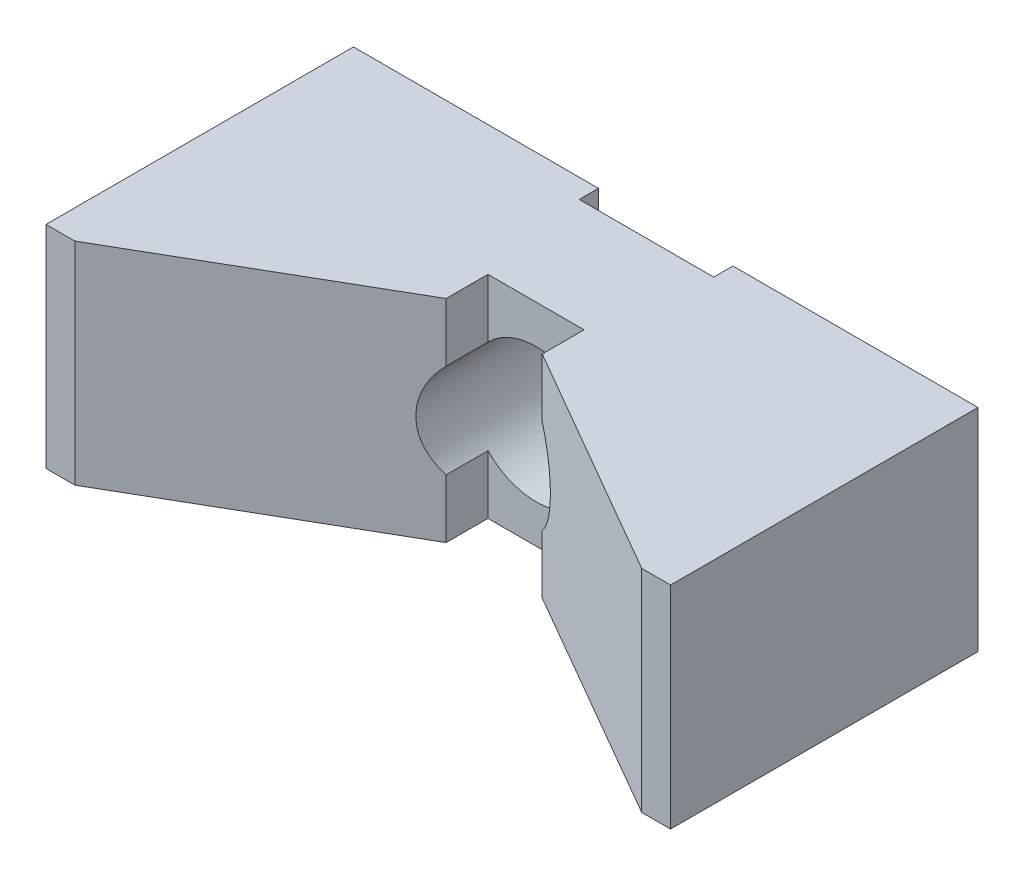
ISO-10303-21;
HEADER;
FILE_DESCRIPTION(('STEP AP214'),'2;1');
FILE_NAME('part.step','',(''),(''),'','','');
FILE_SCHEMA(('AUTOMOTIVE_DESIGN { 1 0 10303 214 1 1 1 1 }'));
ENDSEC;
DATA;
#1=APPLICATION_CONTEXT('core data for automotive mechanical design processes');
#2=APPLICATION_PROTOCOL_DEFINITION('international standard','automotive_design',2000,#1);
#3=PRODUCT_CONTEXT('',#1,'mechanical');
#4=PRODUCT('Part','Part','',(#3));
#5=PRODUCT_RELATED_PRODUCT_CATEGORY('part','',(#4));
#6=PRODUCT_DEFINITION_FORMATION('','',#4);
#7=PRODUCT_DEFINITION_CONTEXT('part definition',#1,'design');
#8=PRODUCT_DEFINITION('design','',#6,#7);
#9=PRODUCT_DEFINITION_SHAPE('','',#8);
#10=(LENGTH_UNIT() NAMED_UNIT(*) SI_UNIT(.MILLI.,.METRE.));
#11=(NAMED_UNIT(*) PLANE_ANGLE_UNIT() SI_UNIT($,.RADIAN.));
#12=(NAMED_UNIT(*) SI_UNIT($,.STERADIAN.) SOLID_ANGLE_UNIT());
#13=UNCERTAINTY_MEASURE_WITH_UNIT(LENGTH_MEASURE(1.E-05),#10,'distance_accuracy_value','');
#14=(GEOMETRIC_REPRESENTATION_CONTEXT(3) GLOBAL_UNCERTAINTY_ASSIGNED_CONTEXT((#13)) GLOBAL_UNIT_ASSIGNED_CONTEXT((#10,
#11,#12)) REPRESENTATION_CONTEXT('',''));
#15=CARTESIAN_POINT('',(0.,0.,0.));
#16=DIRECTION('',(0.,0.,1.));
#17=DIRECTION('',(1.,0.,0.));
#18=AXIS2_PLACEMENT_3D('',#15,#16,#17);
#19=CARTESIAN_POINT('',(-32.5,-11.,0.));
#20=DIRECTION('',(0.,0.,1.));
#21=DIRECTION('',(-1.,0.,0.));
#22=AXIS2_PLACEMENT_3D('',#19,#20,#21);
#23=PLANE('',#22);
#24=DIRECTION('',(1.,0.,0.));
#25=VECTOR('',#24,1.);
#26=CARTESIAN_POINT('',(-32.5,-11.,0.));
#27=LINE('',#26,#25);
#28=CARTESIAN_POINT('',(7.,-11.,0.));
#29=VERTEX_POINT('',#28);
#30=CARTESIAN_POINT('',(32.5,-11.,0.));
#31=VERTEX_POINT('',#30);
#32=EDGE_CURVE('E244',#29,#31,#27,.T.);
#33=ORIENTED_EDGE('',*,*,#32,.F.);
#34=DIRECTION('',(0.,-1.,0.));
#35=VECTOR('',#34,1.);
#36=CARTESIAN_POINT('',(7.,11.,0.));
#37=LINE('',#36,#35);
#38=CARTESIAN_POINT('',(7.,11.,0.));
#39=VERTEX_POINT('',#38);
#40=EDGE_CURVE('E206',#39,#29,#37,.T.);
#41=ORIENTED_EDGE('',*,*,#40,.F.);
#42=DIRECTION('',(1.,0.,0.));
#43=VECTOR('',#42,1.);
#44=CARTESIAN_POINT('',(-32.5,11.,0.));
#45=LINE('',#44,#43);
#46=CARTESIAN_POINT('',(32.5,11.,0.));
#47=VERTEX_POINT('',#46);
#48=EDGE_CURVE('E228',#39,#47,#45,.T.);
#49=ORIENTED_EDGE('',*,*,#48,.T.);
#50=DIRECTION('',(0.,1.,0.));
#51=VECTOR('',#50,1.);
#52=CARTESIAN_POINT('',(32.5,-11.,0.));
#53=LINE('',#52,#51);
#54=EDGE_CURVE('E248',#31,#47,#53,.T.);
#55=ORIENTED_EDGE('',*,*,#54,.F.);
#56=EDGE_LOOP('',(#33,#41,#49,#55));
#57=FACE_BOUND('',#56,.T.);
#58=ADVANCED_FACE('F14',(#57),#23,.F.);
#59=CARTESIAN_POINT('',(32.5,-11.,0.));
#60=DIRECTION('',(-1.,0.,0.));
#61=DIRECTION('',(0.,0.,-1.));
#62=AXIS2_PLACEMENT_3D('',#59,#60,#61);
#63=PLANE('',#62);
#64=DIRECTION('',(0.,0.,1.));
#65=VECTOR('',#64,1.);
#66=CARTESIAN_POINT('',(32.5,11.,0.));
#67=LINE('',#66,#65);
#68=CARTESIAN_POINT('',(32.5,11.,32.));
#69=VERTEX_POINT('',#68);
#70=EDGE_CURVE('E208',#47,#69,#67,.T.);
#71=ORIENTED_EDGE('',*,*,#70,.T.);
#72=DIRECTION('',(0.,1.,0.));
#73=VECTOR('',#72,1.);
#74=CARTESIAN_POINT('',(32.5,-11.,32.));
#75=LINE('',#74,#73);
#76=CARTESIAN_POINT('',(32.5,-11.,32.));
#77=VERTEX_POINT('',#76);
#78=EDGE_CURVE('E263',#77,#69,#75,.T.);
#79=ORIENTED_EDGE('',*,*,#78,.F.);
#80=DIRECTION('',(0.,0.,1.));
#81=VECTOR('',#80,1.);
#82=CARTESIAN_POINT('',(32.5,-11.,0.));
#83=LINE('',#82,#81);
#84=EDGE_CURVE('E232',#31,#77,#83,.T.);
#85=ORIENTED_EDGE('',*,*,#84,.F.);
#86=ORIENTED_EDGE('',*,*,#54,.T.);
#87=EDGE_LOOP('',(#71,#79,#85,#86));
#88=FACE_BOUND('',#87,.T.);
#89=ADVANCED_FACE('F16',(#88),#63,.F.);
#90=CARTESIAN_POINT('',(32.5,-11.,32.));
#91=DIRECTION('',(0.,0.,-1.));
#92=DIRECTION('',(1.,0.,0.));
#93=AXIS2_PLACEMENT_3D('',#90,#91,#92);
#94=PLANE('',#93);
#95=DIRECTION('',(-1.,0.,0.));
#96=VECTOR('',#95,1.);
#97=CARTESIAN_POINT('',(32.5,11.,32.));
#98=LINE('',#97,#96);
#99=CARTESIAN_POINT('',(29.5,11.,32.));
#100=VERTEX_POINT('',#99);
#101=EDGE_CURVE('E217',#69,#100,#98,.T.);
#102=ORIENTED_EDGE('',*,*,#101,.T.);
#103=DIRECTION('',(0.,1.,0.));
#104=VECTOR('',#103,1.);
#105=CARTESIAN_POINT('',(29.5,-11.,32.));
#106=LINE('',#105,#104);
#107=CARTESIAN_POINT('',(29.5,-11.,32.));
#108=VERTEX_POINT('',#107);
#109=EDGE_CURVE('E260',#108,#100,#106,.T.);
#110=ORIENTED_EDGE('',*,*,#109,.F.);
#111=DIRECTION('',(-1.,0.,0.));
#112=VECTOR('',#111,1.);
#113=CARTESIAN_POINT('',(32.5,-11.,32.));
#114=LINE('',#113,#112);
#115=EDGE_CURVE('E235',#77,#108,#114,.T.);
#116=ORIENTED_EDGE('',*,*,#115,.F.);
#117=ORIENTED_EDGE('',*,*,#78,.T.);
#118=EDGE_LOOP('',(#102,#110,#116,#117));
#119=FACE_BOUND('',#118,.T.);
#120=ADVANCED_FACE('F329',(#119),#94,.F.);
#121=CARTESIAN_POINT('',(29.5,-11.,32.));
#122=DIRECTION('',(0.5,0.,-0.86602540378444));
#123=DIRECTION('',(0.86602540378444,0.,0.5));
#124=AXIS2_PLACEMENT_3D('',#121,#122,#123);
#125=PLANE('',#124);
#126=DIRECTION('',(-0.86602540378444,0.,-0.5));
#127=VECTOR('',#126,1.);
#128=CARTESIAN_POINT('',(29.5,11.,32.));
#129=LINE('',#128,#127);
#130=CARTESIAN_POINT('',(5.,11.,17.8549184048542));
#131=VERTEX_POINT('',#130);
#132=EDGE_CURVE('E219',#100,#131,#129,.T.);
#133=ORIENTED_EDGE('',*,*,#132,.T.);
#134=DIRECTION('',(0.,-1.,0.));
#135=VECTOR('',#134,1.);
#136=CARTESIAN_POINT('',(5.,-11.,17.8549184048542));
#137=LINE('',#136,#135);
#138=CARTESIAN_POINT('',(5.,4.89897948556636,17.8549184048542));
#139=VERTEX_POINT('',#138);
#140=EDGE_CURVE('E165',#131,#139,#137,.T.);
#141=ORIENTED_EDGE('',*,*,#140,.T.);
#142=CARTESIAN_POINT('',(0.,0.,14.9681670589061));
#143=DIRECTION('',(0.5,0.,-0.86602540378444));
#144=DIRECTION('',(-0.86602540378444,0.,-0.5));
#145=AXIS2_PLACEMENT_3D('',#142,#143,#144);
#146=ELLIPSE('',#145,8.08290376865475,7.);
#147=CARTESIAN_POINT('',(5.,-4.89897948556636,17.8549184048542));
#148=VERTEX_POINT('',#147);
#149=EDGE_CURVE('E185',#139,#148,#146,.T.);
#150=ORIENTED_EDGE('',*,*,#149,.T.);
#151=CARTESIAN_POINT('',(5.,-11.,17.8549184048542));
#152=VERTEX_POINT('',#151);
#153=EDGE_CURVE('E37',#148,#152,#137,.T.);
#154=ORIENTED_EDGE('',*,*,#153,.T.);
#155=DIRECTION('',(-0.86602540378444,0.,-0.5));
#156=VECTOR('',#155,1.);
#157=CARTESIAN_POINT('',(29.5,-11.,32.));
#158=LINE('',#157,#156);
#159=EDGE_CURVE('E159',#108,#152,#158,.T.);
#160=ORIENTED_EDGE('',*,*,#159,.F.);
#161=ORIENTED_EDGE('',*,*,#109,.T.);
#162=EDGE_LOOP('',(#133,#141,#150,#154,#160,#161));
#163=FACE_BOUND('',#162,.T.);
#164=ADVANCED_FACE('F332',(#163),#125,.F.);
#165=CARTESIAN_POINT('',(-29.5,-11.,32.));
#166=DIRECTION('',(-0.5,0.,-0.86602540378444));
#167=DIRECTION('',(0.86602540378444,0.,-0.5));
#168=AXIS2_PLACEMENT_3D('',#165,#166,#167);
#169=PLANE('',#168);
#170=DIRECTION('',(-0.86602540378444,0.,0.5));
#171=VECTOR('',#170,1.);
#172=CARTESIAN_POINT('',(-29.5,-11.,32.));
#173=LINE('',#172,#171);
#174=CARTESIAN_POINT('',(-5.,-11.,17.8549184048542));
#175=VERTEX_POINT('',#174);
#176=CARTESIAN_POINT('',(-29.5,-11.,32.));
#177=VERTEX_POINT('',#176);
#178=EDGE_CURVE('E238',#175,#177,#173,.T.);
#179=ORIENTED_EDGE('',*,*,#178,.F.);
#180=DIRECTION('',(0.,1.,0.));
#181=VECTOR('',#180,1.);
#182=CARTESIAN_POINT('',(-5.,-11.,17.8549184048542));
#183=LINE('',#182,#181);
#184=CARTESIAN_POINT('',(-5.,-4.89897948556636,17.8549184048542));
#185=VERTEX_POINT('',#184);
#186=EDGE_CURVE('E170',#175,#185,#183,.T.);
#187=ORIENTED_EDGE('',*,*,#186,.T.);
#188=CARTESIAN_POINT('',(0.,0.,14.9681670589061));
#189=DIRECTION('',(-0.5,0.,-0.86602540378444));
#190=DIRECTION('',(0.86602540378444,0.,-0.5));
#191=AXIS2_PLACEMENT_3D('',#188,#189,#190);
#192=ELLIPSE('',#191,8.08290376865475,7.);
#193=CARTESIAN_POINT('',(-5.,4.89897948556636,17.8549184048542));
#194=VERTEX_POINT('',#193);
#195=EDGE_CURVE('E266',#185,#194,#192,.T.);
#196=ORIENTED_EDGE('',*,*,#195,.T.);
#197=CARTESIAN_POINT('',(-5.,11.,17.8549184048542));
#198=VERTEX_POINT('',#197);
#199=EDGE_CURVE('E173',#194,#198,#183,.T.);
#200=ORIENTED_EDGE('',*,*,#199,.T.);
#201=DIRECTION('',(-0.86602540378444,0.,0.5));
#202=VECTOR('',#201,1.);
#203=CARTESIAN_POINT('',(-29.5,11.,32.));
#204=LINE('',#203,#202);
#205=CARTESIAN_POINT('',(-29.5,11.,32.));
#206=VERTEX_POINT('',#205);
#207=EDGE_CURVE('E222',#198,#206,#204,.T.);
#208=ORIENTED_EDGE('',*,*,#207,.T.);
#209=DIRECTION('',(0.,1.,0.));
#210=VECTOR('',#209,1.);
#211=CARTESIAN_POINT('',(-29.5,-11.,32.));
#212=LINE('',#211,#210);
#213=EDGE_CURVE('E257',#177,#206,#212,.T.);
#214=ORIENTED_EDGE('',*,*,#213,.F.);
#215=EDGE_LOOP('',(#179,#187,#196,#200,#208,#214));
#216=FACE_BOUND('',#215,.T.);
#217=ADVANCED_FACE('F288',(#216),#169,.F.);
#218=CARTESIAN_POINT('',(-32.5,-11.,32.));
#219=DIRECTION('',(0.,0.,-1.));
#220=DIRECTION('',(1.,0.,0.));
#221=AXIS2_PLACEMENT_3D('',#218,#219,#220);
#222=PLANE('',#221);
#223=DIRECTION('',(-1.,0.,0.));
#224=VECTOR('',#223,1.);
#225=CARTESIAN_POINT('',(-32.5,11.,32.));
#226=LINE('',#225,#224);
#227=CARTESIAN_POINT('',(-32.5,11.,32.));
#228=VERTEX_POINT('',#227);
#229=EDGE_CURVE('E224',#206,#228,#226,.T.);
#230=ORIENTED_EDGE('',*,*,#229,.T.);
#231=DIRECTION('',(0.,1.,0.));
#232=VECTOR('',#231,1.);
#233=CARTESIAN_POINT('',(-32.5,-11.,32.));
#234=LINE('',#233,#232);
#235=CARTESIAN_POINT('',(-32.5,-11.,32.));
#236=VERTEX_POINT('',#235);
#237=EDGE_CURVE('E254',#236,#228,#234,.T.);
#238=ORIENTED_EDGE('',*,*,#237,.F.);
#239=DIRECTION('',(-1.,0.,0.));
#240=VECTOR('',#239,1.);
#241=CARTESIAN_POINT('',(-32.5,-11.,32.));
#242=LINE('',#241,#240);
#243=EDGE_CURVE('E240',#177,#236,#242,.T.);
#244=ORIENTED_EDGE('',*,*,#243,.F.);
#245=ORIENTED_EDGE('',*,*,#213,.T.);
#246=EDGE_LOOP('',(#230,#238,#244,#245));
#247=FACE_BOUND('',#246,.T.);
#248=ADVANCED_FACE('F295',(#247),#222,.F.);
#249=CARTESIAN_POINT('',(-32.5,-11.,0.));
#250=DIRECTION('',(1.,0.,0.));
#251=DIRECTION('',(0.,0.,1.));
#252=AXIS2_PLACEMENT_3D('',#249,#250,#251);
#253=PLANE('',#252);
#254=DIRECTION('',(0.,0.,-1.));
#255=VECTOR('',#254,1.);
#256=CARTESIAN_POINT('',(-32.5,11.,0.));
#257=LINE('',#256,#255);
#258=CARTESIAN_POINT('',(-32.5,11.,0.));
#259=VERTEX_POINT('',#258);
#260=EDGE_CURVE('E226',#228,#259,#257,.T.);
#261=ORIENTED_EDGE('',*,*,#260,.T.);
#262=DIRECTION('',(0.,1.,0.));
#263=VECTOR('',#262,1.);
#264=CARTESIAN_POINT('',(-32.5,-11.,0.));
#265=LINE('',#264,#263);
#266=CARTESIAN_POINT('',(-32.5,-11.,0.));
#267=VERTEX_POINT('',#266);
#268=EDGE_CURVE('E251',#267,#259,#265,.T.);
#269=ORIENTED_EDGE('',*,*,#268,.F.);
#270=DIRECTION('',(0.,0.,-1.));
#271=VECTOR('',#270,1.);
#272=CARTESIAN_POINT('',(-32.5,-11.,0.));
#273=LINE('',#272,#271);
#274=EDGE_CURVE('E242',#236,#267,#273,.T.);
#275=ORIENTED_EDGE('',*,*,#274,.F.);
#276=ORIENTED_EDGE('',*,*,#237,.T.);
#277=EDGE_LOOP('',(#261,#269,#275,#276));
#278=FACE_BOUND('',#277,.T.);
#279=ADVANCED_FACE('F301',(#278),#253,.F.);
#280=CARTESIAN_POINT('',(-7.,11.,0.));
#281=VERTEX_POINT('',#280);
#282=EDGE_CURVE('E229',#259,#281,#45,.T.);
#283=ORIENTED_EDGE('',*,*,#282,.T.);
#284=DIRECTION('',(0.,-1.,0.));
#285=VECTOR('',#284,1.);
#286=CARTESIAN_POINT('',(-7.,11.,0.));
#287=LINE('',#286,#285);
#288=CARTESIAN_POINT('',(-7.,-11.,0.));
#289=VERTEX_POINT('',#288);
#290=EDGE_CURVE('E209',#281,#289,#287,.T.);
#291=ORIENTED_EDGE('',*,*,#290,.T.);
#292=EDGE_CURVE('E245',#267,#289,#27,.T.);
#293=ORIENTED_EDGE('',*,*,#292,.F.);
#294=ORIENTED_EDGE('',*,*,#268,.T.);
#295=EDGE_LOOP('',(#283,#291,#293,#294));
#296=FACE_BOUND('',#295,.T.);
#297=ADVANCED_FACE('F305',(#296),#23,.F.);
#298=CARTESIAN_POINT('',(32.5,-11.,0.));
#299=DIRECTION('',(0.,1.,0.));
#300=DIRECTION('',(1.,0.,0.));
#301=AXIS2_PLACEMENT_3D('',#298,#299,#300);
#302=PLANE('',#301);
#303=DIRECTION('',(1.,0.,0.));
#304=VECTOR('',#303,1.);
#305=CARTESIAN_POINT('',(5.,-11.,13.5));
#306=LINE('',#305,#304);
#307=CARTESIAN_POINT('',(-5.,-11.,13.5));
#308=VERTEX_POINT('',#307);
#309=CARTESIAN_POINT('',(5.,-11.,13.5));
#310=VERTEX_POINT('',#309);
#311=EDGE_CURVE('E148',#308,#310,#306,.T.);
#312=ORIENTED_EDGE('',*,*,#311,.F.);
#313=DIRECTION('',(0.,0.,-1.));
#314=VECTOR('',#313,1.);
#315=CARTESIAN_POINT('',(-5.,-11.,13.5));
#316=LINE('',#315,#314);
#317=EDGE_CURVE('E145',#175,#308,#316,.T.);
#318=ORIENTED_EDGE('',*,*,#317,.F.);
#319=ORIENTED_EDGE('',*,*,#178,.T.);
#320=ORIENTED_EDGE('',*,*,#243,.T.);
#321=ORIENTED_EDGE('',*,*,#274,.T.);
#322=ORIENTED_EDGE('',*,*,#292,.T.);
#323=DIRECTION('',(0.,0.,-1.));
#324=VECTOR('',#323,1.);
#325=CARTESIAN_POINT('',(-7.,-11.,0.));
#326=LINE('',#325,#324);
#327=CARTESIAN_POINT('',(-7.,-11.,2.));
#328=VERTEX_POINT('',#327);
#329=EDGE_CURVE('E194',#328,#289,#326,.T.);
#330=ORIENTED_EDGE('',*,*,#329,.F.);
#331=DIRECTION('',(-1.,0.,0.));
#332=VECTOR('',#331,1.);
#333=CARTESIAN_POINT('',(7.,-11.,2.));
#334=LINE('',#333,#332);
#335=CARTESIAN_POINT('',(7.,-11.,2.));
#336=VERTEX_POINT('',#335);
#337=EDGE_CURVE('E191',#336,#328,#334,.T.);
#338=ORIENTED_EDGE('',*,*,#337,.F.);
#339=DIRECTION('',(0.,0.,1.));
#340=VECTOR('',#339,1.);
#341=CARTESIAN_POINT('',(7.,-11.,0.));
#342=LINE('',#341,#340);
#343=EDGE_CURVE('E188',#29,#336,#342,.T.);
#344=ORIENTED_EDGE('',*,*,#343,.F.);
#345=ORIENTED_EDGE('',*,*,#32,.T.);
#346=ORIENTED_EDGE('',*,*,#84,.T.);
#347=ORIENTED_EDGE('',*,*,#115,.T.);
#348=ORIENTED_EDGE('',*,*,#159,.T.);
#349=DIRECTION('',(0.,0.,1.));
#350=VECTOR('',#349,1.);
#351=CARTESIAN_POINT('',(5.,-11.,13.5));
#352=LINE('',#351,#350);
#353=EDGE_CURVE('E141',#310,#152,#352,.T.);
#354=ORIENTED_EDGE('',*,*,#353,.F.);
#355=EDGE_LOOP('',(#312,#318,#319,#320,#321,#322,#330,#338,#344,#345,#346,#347,#348,#354));
#356=FACE_BOUND('',#355,.T.);
#357=ADVANCED_FACE('F157',(#356),#302,.F.);
#358=CARTESIAN_POINT('',(32.5,11.,0.));
#359=DIRECTION('',(0.,1.,0.));
#360=DIRECTION('',(1.,0.,0.));
#361=AXIS2_PLACEMENT_3D('',#358,#359,#360);
#362=PLANE('',#361);
#363=DIRECTION('',(0.,0.,1.));
#364=VECTOR('',#363,1.);
#365=CARTESIAN_POINT('',(-5.,11.,0.));
#366=LINE('',#365,#364);
#367=CARTESIAN_POINT('',(-5.,11.,13.5));
#368=VERTEX_POINT('',#367);
#369=EDGE_CURVE('E174',#368,#198,#366,.T.);
#370=ORIENTED_EDGE('',*,*,#369,.F.);
#371=DIRECTION('',(-1.,0.,0.));
#372=VECTOR('',#371,1.);
#373=CARTESIAN_POINT('',(32.5,11.,13.5));
#374=LINE('',#373,#372);
#375=CARTESIAN_POINT('',(5.,11.,13.5));
#376=VERTEX_POINT('',#375);
#377=EDGE_CURVE('E176',#376,#368,#374,.T.);
#378=ORIENTED_EDGE('',*,*,#377,.F.);
#379=DIRECTION('',(0.,0.,-1.));
#380=VECTOR('',#379,1.);
#381=CARTESIAN_POINT('',(5.,11.,0.));
#382=LINE('',#381,#380);
#383=EDGE_CURVE('E168',#131,#376,#382,.T.);
#384=ORIENTED_EDGE('',*,*,#383,.F.);
#385=ORIENTED_EDGE('',*,*,#132,.F.);
#386=ORIENTED_EDGE('',*,*,#101,.F.);
#387=ORIENTED_EDGE('',*,*,#70,.F.);
#388=ORIENTED_EDGE('',*,*,#48,.F.);
#389=DIRECTION('',(0.,0.,1.));
#390=VECTOR('',#389,1.);
#391=CARTESIAN_POINT('',(7.,11.,0.));
#392=LINE('',#391,#390);
#393=CARTESIAN_POINT('',(7.,11.,2.));
#394=VERTEX_POINT('',#393);
#395=EDGE_CURVE('E196',#39,#394,#392,.T.);
#396=ORIENTED_EDGE('',*,*,#395,.T.);
#397=DIRECTION('',(-1.,0.,0.));
#398=VECTOR('',#397,1.);
#399=CARTESIAN_POINT('',(7.,11.,2.));
#400=LINE('',#399,#398);
#401=CARTESIAN_POINT('',(-7.,11.,2.));
#402=VERTEX_POINT('',#401);
#403=EDGE_CURVE('E199',#394,#402,#400,.T.);
#404=ORIENTED_EDGE('',*,*,#403,.T.);
#405=DIRECTION('',(0.,0.,-1.));
#406=VECTOR('',#405,1.);
#407=CARTESIAN_POINT('',(-7.,11.,0.));
#408=LINE('',#407,#406);
#409=EDGE_CURVE('E202',#402,#281,#408,.T.);
#410=ORIENTED_EDGE('',*,*,#409,.T.);
#411=ORIENTED_EDGE('',*,*,#282,.F.);
#412=ORIENTED_EDGE('',*,*,#260,.F.);
#413=ORIENTED_EDGE('',*,*,#229,.F.);
#414=ORIENTED_EDGE('',*,*,#207,.F.);
#415=EDGE_LOOP('',(#370,#378,#384,#385,#386,#387,#388,#396,#404,#410,#411,#412,#413,#414));
#416=FACE_BOUND('',#415,.T.);
#417=ADVANCED_FACE('F311',(#416),#362,.T.);
#418=CARTESIAN_POINT('',(7.,11.,0.));
#419=DIRECTION('',(1.,0.,0.));
#420=DIRECTION('',(0.,0.,1.));
#421=AXIS2_PLACEMENT_3D('',#418,#419,#420);
#422=PLANE('',#421);
#423=DIRECTION('',(0.,-1.,0.));
#424=VECTOR('',#423,1.);
#425=CARTESIAN_POINT('',(7.,11.,2.));
#426=LINE('',#425,#424);
#427=EDGE_CURVE('E205',#394,#336,#426,.T.);
#428=ORIENTED_EDGE('',*,*,#427,.F.);
#429=ORIENTED_EDGE('',*,*,#395,.F.);
#430=ORIENTED_EDGE('',*,*,#40,.T.);
#431=ORIENTED_EDGE('',*,*,#343,.T.);
#432=EDGE_LOOP('',(#428,#429,#430,#431));
#433=FACE_BOUND('',#432,.T.);
#434=ADVANCED_FACE('F485',(#433),#422,.F.);
#435=CARTESIAN_POINT('',(-7.,11.,0.));
#436=DIRECTION('',(-1.,0.,0.));
#437=DIRECTION('',(0.,0.,-1.));
#438=AXIS2_PLACEMENT_3D('',#435,#436,#437);
#439=PLANE('',#438);
#440=ORIENTED_EDGE('',*,*,#290,.F.);
#441=ORIENTED_EDGE('',*,*,#409,.F.);
#442=DIRECTION('',(0.,-1.,0.));
#443=VECTOR('',#442,1.);
#444=CARTESIAN_POINT('',(-7.,11.,2.));
#445=LINE('',#444,#443);
#446=EDGE_CURVE('E212',#402,#328,#445,.T.);
#447=ORIENTED_EDGE('',*,*,#446,.T.);
#448=ORIENTED_EDGE('',*,*,#329,.T.);
#449=EDGE_LOOP('',(#440,#441,#447,#448));
#450=FACE_BOUND('',#449,.T.);
#451=ADVANCED_FACE('F307',(#450),#439,.F.);
#452=CARTESIAN_POINT('',(7.,11.,2.));
#453=DIRECTION('',(0.,0.,1.));
#454=DIRECTION('',(-1.,0.,0.));
#455=AXIS2_PLACEMENT_3D('',#452,#453,#454);
#456=PLANE('',#455);
#457=CARTESIAN_POINT('',(0.,0.,2.));
#458=DIRECTION('',(0.,0.,-1.));
#459=DIRECTION('',(0.,-1.,0.));
#460=AXIS2_PLACEMENT_3D('',#457,#458,#459);
#461=CIRCLE('',#460,4.5);
#462=CARTESIAN_POINT('',(0.,-4.5,2.));
#463=VERTEX_POINT('',#462);
#464=EDGE_CURVE('E178',#463,#463,#461,.T.);
#465=ORIENTED_EDGE('',*,*,#464,.F.);
#466=EDGE_LOOP('',(#465));
#467=FACE_BOUND('',#466,.T.);
#468=ORIENTED_EDGE('',*,*,#446,.F.);
#469=ORIENTED_EDGE('',*,*,#403,.F.);
#470=ORIENTED_EDGE('',*,*,#427,.T.);
#471=ORIENTED_EDGE('',*,*,#337,.T.);
#472=EDGE_LOOP('',(#468,#469,#470,#471));
#473=FACE_BOUND('',#472,.T.);
#474=ADVANCED_FACE('F315',(#467,#473),#456,.F.);
#475=CARTESIAN_POINT('',(0.,0.,32.));
#476=DIRECTION('',(0.,0.,-1.));
#477=DIRECTION('',(1.,0.,0.));
#478=AXIS2_PLACEMENT_3D('',#475,#476,#477);
#479=CYLINDRICAL_SURFACE('',#478,7.);
#480=CARTESIAN_POINT('',(0.,0.,5.5));
#481=DIRECTION('',(0.,0.,-1.));
#482=DIRECTION('',(1.,0.,0.));
#483=AXIS2_PLACEMENT_3D('',#480,#481,#482);
#484=CIRCLE('',#483,7.);
#485=CARTESIAN_POINT('',(7.,0.,5.5));
#486=VERTEX_POINT('',#485);
#487=EDGE_CURVE('E182',#486,#486,#484,.T.);
#488=ORIENTED_EDGE('',*,*,#487,.T.);
#489=EDGE_LOOP('',(#488));
#490=FACE_BOUND('',#489,.T.);
#491=ORIENTED_EDGE('',*,*,#195,.F.);
#492=DIRECTION('',(0.,0.,-1.));
#493=VECTOR('',#492,1.);
#494=CARTESIAN_POINT('',(-5.,-4.89897948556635,32.));
#495=LINE('',#494,#493);
#496=CARTESIAN_POINT('',(-5.,-4.89897948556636,13.5));
#497=VERTEX_POINT('',#496);
#498=EDGE_CURVE('E9',#185,#497,#495,.T.);
#499=ORIENTED_EDGE('',*,*,#498,.T.);
#500=CARTESIAN_POINT('',(0.,0.,13.5));
#501=DIRECTION('',(0.,0.,-1.));
#502=DIRECTION('',(1.,0.,0.));
#503=AXIS2_PLACEMENT_3D('',#500,#501,#502);
#504=CIRCLE('',#503,7.);
#505=CARTESIAN_POINT('',(5.,-4.89897948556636,13.5));
#506=VERTEX_POINT('',#505);
#507=EDGE_CURVE('E22',#497,#506,#504,.F.);
#508=ORIENTED_EDGE('',*,*,#507,.T.);
#509=DIRECTION('',(0.,0.,-1.));
#510=VECTOR('',#509,1.);
#511=CARTESIAN_POINT('',(5.,-4.89897948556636,32.));
#512=LINE('',#511,#510);
#513=EDGE_CURVE('E142',#506,#148,#512,.F.);
#514=ORIENTED_EDGE('',*,*,#513,.T.);
#515=ORIENTED_EDGE('',*,*,#149,.F.);
#516=DIRECTION('',(0.,0.,-1.));
#517=VECTOR('',#516,1.);
#518=CARTESIAN_POINT('',(5.,4.89897948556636,32.));
#519=LINE('',#518,#517);
#520=CARTESIAN_POINT('',(5.,4.89897948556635,13.5));
#521=VERTEX_POINT('',#520);
#522=EDGE_CURVE('E269',#139,#521,#519,.T.);
#523=ORIENTED_EDGE('',*,*,#522,.T.);
#524=CARTESIAN_POINT('',(-5.,4.89897948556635,13.5));
#525=VERTEX_POINT('',#524);
#526=EDGE_CURVE('E274',#521,#525,#504,.F.);
#527=ORIENTED_EDGE('',*,*,#526,.T.);
#528=DIRECTION('',(0.,0.,-1.));
#529=VECTOR('',#528,1.);
#530=CARTESIAN_POINT('',(-5.,4.89897948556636,32.));
#531=LINE('',#530,#529);
#532=EDGE_CURVE('E277',#525,#194,#531,.F.);
#533=ORIENTED_EDGE('',*,*,#532,.T.);
#534=EDGE_LOOP('',(#491,#499,#508,#514,#515,#523,#527,#533));
#535=FACE_BOUND('',#534,.T.);
#536=ADVANCED_FACE('F282',(#490,#535),#479,.F.);
#537=CARTESIAN_POINT('',(0.,0.,5.5));
#538=DIRECTION('',(0.,0.,-1.));
#539=DIRECTION('',(1.,0.,0.));
#540=AXIS2_PLACEMENT_3D('',#537,#538,#539);
#541=PLANE('',#540);
#542=CARTESIAN_POINT('',(0.,0.,5.5));
#543=DIRECTION('',(0.,0.,-1.));
#544=DIRECTION('',(1.,0.,0.));
#545=AXIS2_PLACEMENT_3D('',#542,#543,#544);
#546=CIRCLE('',#545,4.5);
#547=CARTESIAN_POINT('',(4.5,0.,5.5));
#548=VERTEX_POINT('',#547);
#549=EDGE_CURVE('E181',#548,#548,#546,.T.);
#550=ORIENTED_EDGE('',*,*,#549,.T.);
#551=EDGE_LOOP('',(#550));
#552=FACE_BOUND('',#551,.T.);
#553=ORIENTED_EDGE('',*,*,#487,.F.);
#554=EDGE_LOOP('',(#553));
#555=FACE_BOUND('',#554,.T.);
#556=ADVANCED_FACE('F352',(#552,#555),#541,.F.);
#557=CARTESIAN_POINT('',(0.,0.,32.));
#558=DIRECTION('',(0.,0.,-1.));
#559=DIRECTION('',(0.,-1.,0.));
#560=AXIS2_PLACEMENT_3D('',#557,#558,#559);
#561=CYLINDRICAL_SURFACE('',#560,4.5);
#562=ORIENTED_EDGE('',*,*,#464,.T.);
#563=EDGE_LOOP('',(#562));
#564=FACE_BOUND('',#563,.T.);
#565=ORIENTED_EDGE('',*,*,#549,.F.);
#566=EDGE_LOOP('',(#565));
#567=FACE_BOUND('',#566,.T.);
#568=ADVANCED_FACE('F343',(#564,#567),#561,.F.);
#569=CARTESIAN_POINT('',(-5.,29.,13.5));
#570=DIRECTION('',(-1.,0.,0.));
#571=DIRECTION('',(0.,0.,-1.));
#572=AXIS2_PLACEMENT_3D('',#569,#570,#571);
#573=PLANE('',#572);
#574=ORIENTED_EDGE('',*,*,#369,.T.);
#575=ORIENTED_EDGE('',*,*,#199,.F.);
#576=ORIENTED_EDGE('',*,*,#532,.F.);
#577=DIRECTION('',(0.,-1.,0.));
#578=VECTOR('',#577,1.);
#579=CARTESIAN_POINT('',(-5.,29.,13.5));
#580=LINE('',#579,#578);
#581=EDGE_CURVE('E163',#368,#525,#580,.T.);
#582=ORIENTED_EDGE('',*,*,#581,.F.);
#583=EDGE_LOOP('',(#574,#575,#576,#582));
#584=FACE_BOUND('',#583,.T.);
#585=ADVANCED_FACE('F341',(#584),#573,.F.);
#586=CARTESIAN_POINT('',(5.,29.,13.5));
#587=DIRECTION('',(1.,0.,0.));
#588=DIRECTION('',(0.,0.,1.));
#589=AXIS2_PLACEMENT_3D('',#586,#587,#588);
#590=PLANE('',#589);
#591=ORIENTED_EDGE('',*,*,#383,.T.);
#592=DIRECTION('',(0.,-1.,0.));
#593=VECTOR('',#592,1.);
#594=CARTESIAN_POINT('',(5.,29.,13.5));
#595=LINE('',#594,#593);
#596=EDGE_CURVE('E29',#376,#521,#595,.T.);
#597=ORIENTED_EDGE('',*,*,#596,.T.);
#598=ORIENTED_EDGE('',*,*,#522,.F.);
#599=ORIENTED_EDGE('',*,*,#140,.F.);
#600=EDGE_LOOP('',(#591,#597,#598,#599));
#601=FACE_BOUND('',#600,.T.);
#602=ADVANCED_FACE('F333',(#601),#590,.F.);
#603=CARTESIAN_POINT('',(5.,29.,13.5));
#604=DIRECTION('',(0.,0.,-1.));
#605=DIRECTION('',(1.,0.,0.));
#606=AXIS2_PLACEMENT_3D('',#603,#604,#605);
#607=PLANE('',#606);
#608=ORIENTED_EDGE('',*,*,#377,.T.);
#609=ORIENTED_EDGE('',*,*,#581,.T.);
#610=ORIENTED_EDGE('',*,*,#526,.F.);
#611=ORIENTED_EDGE('',*,*,#596,.F.);
#612=EDGE_LOOP('',(#608,#609,#610,#611));
#613=FACE_BOUND('',#612,.T.);
#614=ADVANCED_FACE('F339',(#613),#607,.F.);
#615=EDGE_CURVE('E151',#497,#308,#580,.T.);
#616=ORIENTED_EDGE('',*,*,#615,.T.);
#617=ORIENTED_EDGE('',*,*,#311,.T.);
#618=EDGE_CURVE('E137',#506,#310,#595,.T.);
#619=ORIENTED_EDGE('',*,*,#618,.F.);
#620=ORIENTED_EDGE('',*,*,#507,.F.);
#621=EDGE_LOOP('',(#616,#617,#619,#620));
#622=FACE_BOUND('',#621,.T.);
#623=ADVANCED_FACE('F149',(#622),#607,.F.);
#624=ORIENTED_EDGE('',*,*,#317,.T.);
#625=ORIENTED_EDGE('',*,*,#615,.F.);
#626=ORIENTED_EDGE('',*,*,#498,.F.);
#627=ORIENTED_EDGE('',*,*,#186,.F.);
#628=EDGE_LOOP('',(#624,#625,#626,#627));
#629=FACE_BOUND('',#628,.T.);
#630=ADVANCED_FACE('F284',(#629),#573,.F.);
#631=ORIENTED_EDGE('',*,*,#513,.F.);
#632=ORIENTED_EDGE('',*,*,#618,.T.);
#633=ORIENTED_EDGE('',*,*,#353,.T.);
#634=ORIENTED_EDGE('',*,*,#153,.F.);
#635=EDGE_LOOP('',(#631,#632,#633,#634));
#636=FACE_BOUND('',#635,.T.);
#637=ADVANCED_FACE('F139',(#636),#590,.F.);
#638=CLOSED_SHELL('',(#58,#89,#120,#164,#217,#248,#279,#297,#357,#417,#434,#451,#474,#536,#556,
#568,#585,#602,#614,#623,#630,#637));
#639=MANIFOLD_SOLID_BREP('B1',#638);
#640=ADVANCED_BREP_SHAPE_REPRESENTATION('',(#18,#639),#14);
#641=SHAPE_DEFINITION_REPRESENTATION(#9,#640);
ENDSEC;
END-ISO-10303-21;
